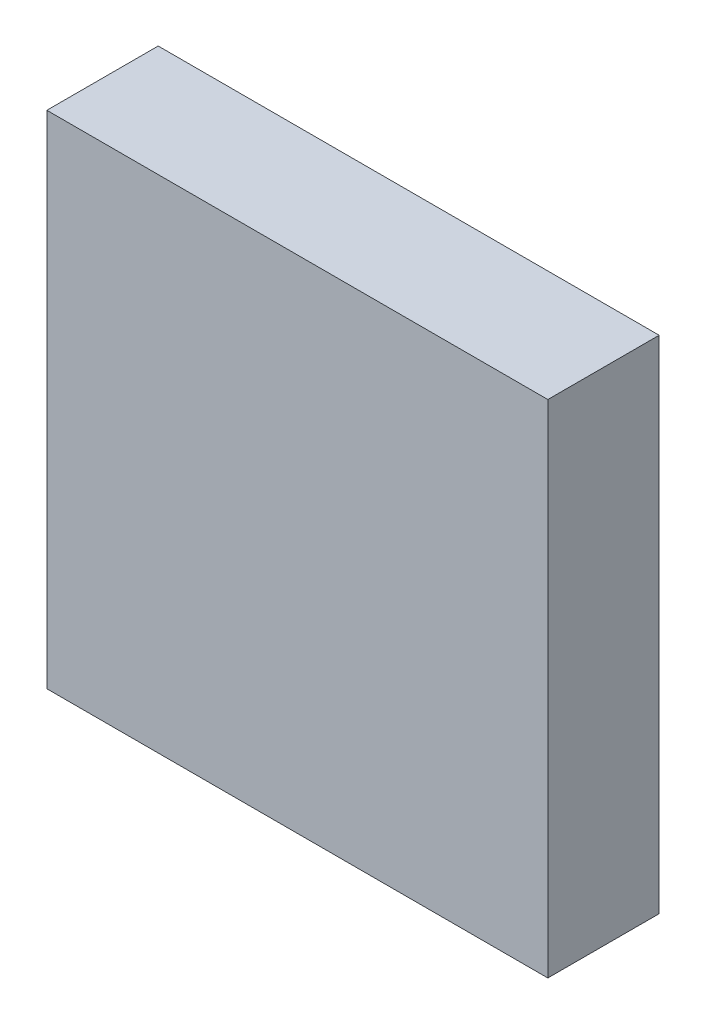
ISO-10303-21;
HEADER;
FILE_DESCRIPTION(('STEP AP214'),'2;1');
FILE_NAME('part.step','',(''),(''),'','','');
FILE_SCHEMA(('AUTOMOTIVE_DESIGN { 1 0 10303 214 1 1 1 1 }'));
ENDSEC;
DATA;
#1=APPLICATION_CONTEXT('core data for automotive mechanical design processes');
#2=APPLICATION_PROTOCOL_DEFINITION('international standard','automotive_design',2000,#1);
#3=PRODUCT_CONTEXT('',#1,'mechanical');
#4=PRODUCT('Part','Part','',(#3));
#5=PRODUCT_RELATED_PRODUCT_CATEGORY('part','',(#4));
#6=PRODUCT_DEFINITION_FORMATION('','',#4);
#7=PRODUCT_DEFINITION_CONTEXT('part definition',#1,'design');
#8=PRODUCT_DEFINITION('design','',#6,#7);
#9=PRODUCT_DEFINITION_SHAPE('','',#8);
#10=(LENGTH_UNIT() NAMED_UNIT(*) SI_UNIT(.MILLI.,.METRE.));
#11=(NAMED_UNIT(*) PLANE_ANGLE_UNIT() SI_UNIT($,.RADIAN.));
#12=(NAMED_UNIT(*) SI_UNIT($,.STERADIAN.) SOLID_ANGLE_UNIT());
#13=UNCERTAINTY_MEASURE_WITH_UNIT(LENGTH_MEASURE(1.E-05),#10,'distance_accuracy_value','');
#14=(GEOMETRIC_REPRESENTATION_CONTEXT(3) GLOBAL_UNCERTAINTY_ASSIGNED_CONTEXT((#13)) GLOBAL_UNIT_ASSIGNED_CONTEXT((#10,
#11,#12)) REPRESENTATION_CONTEXT('',''));
#15=CARTESIAN_POINT('',(0.,0.,0.));
#16=DIRECTION('',(0.,0.,1.));
#17=DIRECTION('',(1.,0.,0.));
#18=AXIS2_PLACEMENT_3D('',#15,#16,#17);
#19=CARTESIAN_POINT('',(-57.15,57.15,12.7));
#20=DIRECTION('',(0.,0.,1.));
#21=DIRECTION('',(1.,0.,0.));
#22=AXIS2_PLACEMENT_3D('',#19,#20,#21);
#23=PLANE('',#22);
#24=DIRECTION('',(1.,0.,0.));
#25=VECTOR('',#24,1.);
#26=CARTESIAN_POINT('',(57.15,-57.15,12.7));
#27=LINE('',#26,#25);
#28=CARTESIAN_POINT('',(57.15,-57.15,12.7));
#29=VERTEX_POINT('',#28);
#30=CARTESIAN_POINT('',(-57.15,-57.15,12.7));
#31=VERTEX_POINT('',#30);
#32=EDGE_CURVE('E19',#29,#31,#27,.F.);
#33=ORIENTED_EDGE('',*,*,#32,.F.);
#34=DIRECTION('',(0.,1.,0.));
#35=VECTOR('',#34,1.);
#36=CARTESIAN_POINT('',(57.15,57.15,12.7));
#37=LINE('',#36,#35);
#38=CARTESIAN_POINT('',(57.15,57.15,12.7));
#39=VERTEX_POINT('',#38);
#40=EDGE_CURVE('E57',#39,#29,#37,.F.);
#41=ORIENTED_EDGE('',*,*,#40,.F.);
#42=DIRECTION('',(1.,0.,0.));
#43=VECTOR('',#42,1.);
#44=CARTESIAN_POINT('',(-57.15,57.15,12.7));
#45=LINE('',#44,#43);
#46=CARTESIAN_POINT('',(-57.15,57.15,12.7));
#47=VERTEX_POINT('',#46);
#48=EDGE_CURVE('E52',#47,#39,#45,.T.);
#49=ORIENTED_EDGE('',*,*,#48,.F.);
#50=DIRECTION('',(0.,1.,0.));
#51=VECTOR('',#50,1.);
#52=CARTESIAN_POINT('',(-57.15,-57.15,12.7));
#53=LINE('',#52,#51);
#54=EDGE_CURVE('E67',#31,#47,#53,.T.);
#55=ORIENTED_EDGE('',*,*,#54,.F.);
#56=EDGE_LOOP('',(#33,#41,#49,#55));
#57=FACE_BOUND('',#56,.T.);
#58=ADVANCED_FACE('F16',(#57),#23,.T.);
#59=CARTESIAN_POINT('',(57.15,-57.15,-12.7));
#60=DIRECTION('',(0.,-1.,0.));
#61=DIRECTION('',(0.,0.,-1.));
#62=AXIS2_PLACEMENT_3D('',#59,#60,#61);
#63=PLANE('',#62);
#64=DIRECTION('',(1.,0.,0.));
#65=VECTOR('',#64,1.);
#66=CARTESIAN_POINT('',(0.,-57.15,-12.7));
#67=LINE('',#66,#65);
#68=CARTESIAN_POINT('',(-57.15,-57.15,-12.7));
#69=VERTEX_POINT('',#68);
#70=CARTESIAN_POINT('',(57.15,-57.15,-12.7));
#71=VERTEX_POINT('',#70);
#72=EDGE_CURVE('E73',#69,#71,#67,.T.);
#73=ORIENTED_EDGE('',*,*,#72,.T.);
#74=DIRECTION('',(0.,0.,-1.));
#75=VECTOR('',#74,1.);
#76=CARTESIAN_POINT('',(57.15,-57.15,-12.7));
#77=LINE('',#76,#75);
#78=EDGE_CURVE('E62',#29,#71,#77,.T.);
#79=ORIENTED_EDGE('',*,*,#78,.F.);
#80=ORIENTED_EDGE('',*,*,#32,.T.);
#81=DIRECTION('',(0.,0.,1.));
#82=VECTOR('',#81,1.);
#83=CARTESIAN_POINT('',(-57.15,-57.15,-12.7));
#84=LINE('',#83,#82);
#85=EDGE_CURVE('E80',#69,#31,#84,.T.);
#86=ORIENTED_EDGE('',*,*,#85,.F.);
#87=EDGE_LOOP('',(#73,#79,#80,#86));
#88=FACE_BOUND('',#87,.T.);
#89=ADVANCED_FACE('F72',(#88),#63,.T.);
#90=CARTESIAN_POINT('',(57.15,57.15,-12.7));
#91=DIRECTION('',(1.,0.,0.));
#92=DIRECTION('',(0.,0.,-1.));
#93=AXIS2_PLACEMENT_3D('',#90,#91,#92);
#94=PLANE('',#93);
#95=DIRECTION('',(0.,1.,0.));
#96=VECTOR('',#95,1.);
#97=CARTESIAN_POINT('',(57.15,0.,-12.7));
#98=LINE('',#97,#96);
#99=CARTESIAN_POINT('',(57.15,57.15,-12.7));
#100=VERTEX_POINT('',#99);
#101=EDGE_CURVE('E83',#71,#100,#98,.T.);
#102=ORIENTED_EDGE('',*,*,#101,.T.);
#103=DIRECTION('',(0.,0.,1.));
#104=VECTOR('',#103,1.);
#105=CARTESIAN_POINT('',(57.15,57.15,-12.7));
#106=LINE('',#105,#104);
#107=EDGE_CURVE('E64',#39,#100,#106,.F.);
#108=ORIENTED_EDGE('',*,*,#107,.F.);
#109=ORIENTED_EDGE('',*,*,#40,.T.);
#110=ORIENTED_EDGE('',*,*,#78,.T.);
#111=EDGE_LOOP('',(#102,#108,#109,#110));
#112=FACE_BOUND('',#111,.T.);
#113=ADVANCED_FACE('F60',(#112),#94,.T.);
#114=CARTESIAN_POINT('',(-57.15,57.15,-12.7));
#115=DIRECTION('',(0.,1.,0.));
#116=DIRECTION('',(0.,0.,1.));
#117=AXIS2_PLACEMENT_3D('',#114,#115,#116);
#118=PLANE('',#117);
#119=DIRECTION('',(1.,0.,0.));
#120=VECTOR('',#119,1.);
#121=CARTESIAN_POINT('',(0.,57.15,-12.7));
#122=LINE('',#121,#120);
#123=CARTESIAN_POINT('',(-57.15,57.15,-12.7));
#124=VERTEX_POINT('',#123);
#125=EDGE_CURVE('E25',#100,#124,#122,.F.);
#126=ORIENTED_EDGE('',*,*,#125,.T.);
#127=DIRECTION('',(0.,0.,1.));
#128=VECTOR('',#127,1.);
#129=CARTESIAN_POINT('',(-57.15,57.15,-12.7));
#130=LINE('',#129,#128);
#131=EDGE_CURVE('E33',#47,#124,#130,.F.);
#132=ORIENTED_EDGE('',*,*,#131,.F.);
#133=ORIENTED_EDGE('',*,*,#48,.T.);
#134=ORIENTED_EDGE('',*,*,#107,.T.);
#135=EDGE_LOOP('',(#126,#132,#133,#134));
#136=FACE_BOUND('',#135,.T.);
#137=ADVANCED_FACE('F87',(#136),#118,.T.);
#138=CARTESIAN_POINT('',(-57.15,-57.15,-12.7));
#139=DIRECTION('',(-1.,0.,0.));
#140=DIRECTION('',(0.,0.,1.));
#141=AXIS2_PLACEMENT_3D('',#138,#139,#140);
#142=PLANE('',#141);
#143=DIRECTION('',(0.,1.,0.));
#144=VECTOR('',#143,1.);
#145=CARTESIAN_POINT('',(-57.15,0.,-12.7));
#146=LINE('',#145,#144);
#147=EDGE_CURVE('E11',#124,#69,#146,.F.);
#148=ORIENTED_EDGE('',*,*,#147,.T.);
#149=ORIENTED_EDGE('',*,*,#85,.T.);
#150=ORIENTED_EDGE('',*,*,#54,.T.);
#151=ORIENTED_EDGE('',*,*,#131,.T.);
#152=EDGE_LOOP('',(#148,#149,#150,#151));
#153=FACE_BOUND('',#152,.T.);
#154=ADVANCED_FACE('F90',(#153),#142,.T.);
#155=CARTESIAN_POINT('',(0.,0.,-12.7));
#156=DIRECTION('',(0.,0.,1.));
#157=DIRECTION('',(1.,0.,0.));
#158=AXIS2_PLACEMENT_3D('',#155,#156,#157);
#159=PLANE('',#158);
#160=ORIENTED_EDGE('',*,*,#125,.F.);
#161=ORIENTED_EDGE('',*,*,#101,.F.);
#162=ORIENTED_EDGE('',*,*,#72,.F.);
#163=ORIENTED_EDGE('',*,*,#147,.F.);
#164=EDGE_LOOP('',(#160,#161,#162,#163));
#165=FACE_BOUND('',#164,.T.);
#166=ADVANCED_FACE('F89',(#165),#159,.F.);
#167=CLOSED_SHELL('',(#58,#89,#113,#137,#154,#166));
#168=MANIFOLD_SOLID_BREP('B1',#167);
#169=ADVANCED_BREP_SHAPE_REPRESENTATION('',(#18,#168),#14);
#170=SHAPE_DEFINITION_REPRESENTATION(#9,#169);
ENDSEC;
END-ISO-10303-21;
